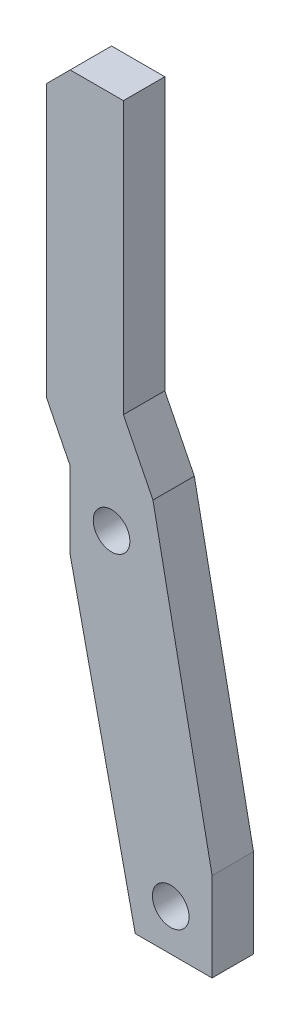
from build123d import *

# Parameters (mm, degrees)
PARALLEL_FINGER_DEPTH     = 3.5
SKETCH_2_R                = 3.1
FINGER_PIVOTS_10X50_DEPTH = 250


with BuildPart() as part:
    # Sketch 1 → Parallel_Finger (new, symmetric)
    with BuildSketch(Plane.XY):
        Polygon((7, -7), (-6, -7), (-17, 43), (-17, 56), (-21, 64), (-21, 110), (-17, 114), (-8, 114), (-8, 68), (-3, 58), (7, 8), align=None)
    extrude(amount=PARALLEL_FINGER_DEPTH, both=True)

    # Sketch 2 → Finger_Pivots_10x50 (cut, symmetric)
    with BuildSketch(Plane.XY):
        with Locations(Location((0, 0, 0), (0, 0, 180))):
            Circle(SKETCH_2_R)
        with Locations(Location((-10, 50, 0), (0, 0, 180))):
            Circle(SKETCH_2_R)
    extrude(amount=FINGER_PIVOTS_10X50_DEPTH, both=True, mode=Mode.SUBTRACT)


solid = part.part
